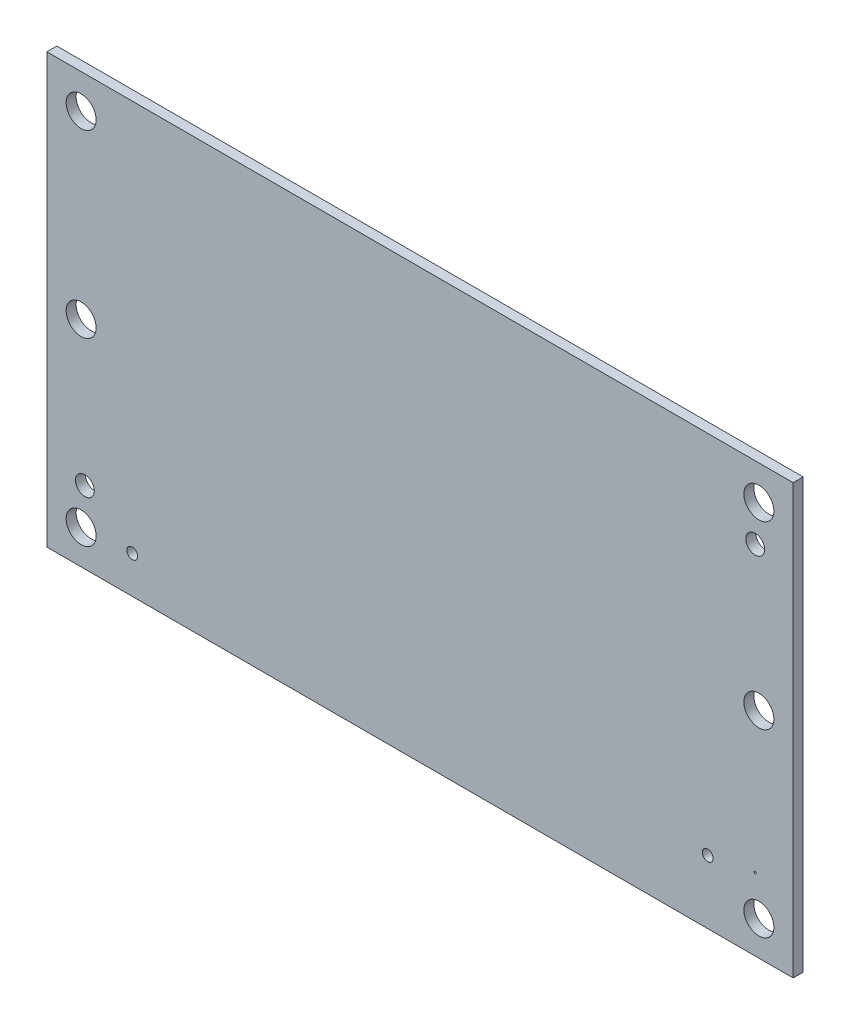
ISO-10303-21;
HEADER;
FILE_DESCRIPTION(('STEP AP214'),'2;1');
FILE_NAME('part.step','',(''),(''),'','','');
FILE_SCHEMA(('AUTOMOTIVE_DESIGN { 1 0 10303 214 1 1 1 1 }'));
ENDSEC;
DATA;
#1=APPLICATION_CONTEXT('core data for automotive mechanical design processes');
#2=APPLICATION_PROTOCOL_DEFINITION('international standard','automotive_design',2000,#1);
#3=PRODUCT_CONTEXT('',#1,'mechanical');
#4=PRODUCT('Part','Part','',(#3));
#5=PRODUCT_RELATED_PRODUCT_CATEGORY('part','',(#4));
#6=PRODUCT_DEFINITION_FORMATION('','',#4);
#7=PRODUCT_DEFINITION_CONTEXT('part definition',#1,'design');
#8=PRODUCT_DEFINITION('design','',#6,#7);
#9=PRODUCT_DEFINITION_SHAPE('','',#8);
#10=(LENGTH_UNIT() NAMED_UNIT(*) SI_UNIT(.MILLI.,.METRE.));
#11=(NAMED_UNIT(*) PLANE_ANGLE_UNIT() SI_UNIT($,.RADIAN.));
#12=(NAMED_UNIT(*) SI_UNIT($,.STERADIAN.) SOLID_ANGLE_UNIT());
#13=UNCERTAINTY_MEASURE_WITH_UNIT(LENGTH_MEASURE(1.E-05),#10,'distance_accuracy_value','');
#14=(GEOMETRIC_REPRESENTATION_CONTEXT(3) GLOBAL_UNCERTAINTY_ASSIGNED_CONTEXT((#13)) GLOBAL_UNIT_ASSIGNED_CONTEXT((#10,
#11,#12)) REPRESENTATION_CONTEXT('',''));
#15=CARTESIAN_POINT('',(0.,0.,0.));
#16=DIRECTION('',(0.,0.,1.));
#17=DIRECTION('',(1.,0.,0.));
#18=AXIS2_PLACEMENT_3D('',#15,#16,#17);
#19=CARTESIAN_POINT('',(0.,0.,1.16399999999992));
#20=DIRECTION('',(0.,0.,1.));
#21=DIRECTION('',(1.,0.,0.));
#22=AXIS2_PLACEMENT_3D('',#19,#20,#21);
#23=PLANE('',#22);
#24=CARTESIAN_POINT('',(5.9599999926,0.3500000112,1.16399999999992));
#25=DIRECTION('',(0.,0.,1.));
#26=DIRECTION('',(1.,0.,0.));
#27=AXIS2_PLACEMENT_3D('',#24,#25,#26);
#28=CIRCLE('',#27,0.635);
#29=CARTESIAN_POINT('',(6.5949999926,0.3500000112,1.16399999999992));
#30=VERTEX_POINT('',#29);
#31=EDGE_CURVE('E112',#30,#30,#28,.F.);
#32=ORIENTED_EDGE('',*,*,#31,.T.);
#33=EDGE_LOOP('',(#32));
#34=FACE_BOUND('',#33,.T.);
#35=CARTESIAN_POINT('',(73.0399999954,3.4000000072,1.16399999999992));
#36=DIRECTION('',(0.,0.,1.));
#37=DIRECTION('',(1.,0.,0.));
#38=AXIS2_PLACEMENT_3D('',#35,#36,#37);
#39=CIRCLE('',#38,0.635);
#40=CARTESIAN_POINT('',(73.6749999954,3.4000000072,1.16399999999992));
#41=VERTEX_POINT('',#40);
#42=EDGE_CURVE('E115',#41,#41,#39,.F.);
#43=ORIENTED_EDGE('',*,*,#42,.T.);
#44=EDGE_LOOP('',(#43));
#45=FACE_BOUND('',#44,.T.);
#46=CARTESIAN_POINT('',(78.5700000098,4.4300000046,1.16399999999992));
#47=DIRECTION('',(0.,0.,1.));
#48=DIRECTION('',(1.,0.,0.));
#49=AXIS2_PLACEMENT_3D('',#46,#47,#48);
#50=CIRCLE('',#49,0.125000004);
#51=CARTESIAN_POINT('',(78.6950000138,4.4300000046,1.16399999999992));
#52=VERTEX_POINT('',#51);
#53=EDGE_CURVE('E118',#52,#52,#50,.F.);
#54=ORIENTED_EDGE('',*,*,#53,.T.);
#55=EDGE_LOOP('',(#54));
#56=FACE_BOUND('',#55,.T.);
#57=CARTESIAN_POINT('',(78.5700000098,37.5799999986,1.16399999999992));
#58=DIRECTION('',(0.,0.,1.));
#59=DIRECTION('',(1.,0.,0.));
#60=AXIS2_PLACEMENT_3D('',#57,#58,#59);
#61=CIRCLE('',#60,1.0999999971);
#62=CARTESIAN_POINT('',(79.6700000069,37.5799999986,1.16399999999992));
#63=VERTEX_POINT('',#62);
#64=EDGE_CURVE('E121',#63,#63,#61,.F.);
#65=ORIENTED_EDGE('',*,*,#64,.T.);
#66=EDGE_LOOP('',(#65));
#67=FACE_BOUND('',#66,.T.);
#68=CARTESIAN_POINT('',(0.4319999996,4.4180000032,1.16399999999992));
#69=DIRECTION('',(0.,0.,1.));
#70=DIRECTION('',(1.,0.,0.));
#71=AXIS2_PLACEMENT_3D('',#68,#69,#70);
#72=CIRCLE('',#71,1.0999999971);
#73=CARTESIAN_POINT('',(1.5319999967,4.4180000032,1.16399999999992));
#74=VERTEX_POINT('',#73);
#75=EDGE_CURVE('E124',#74,#74,#72,.F.);
#76=ORIENTED_EDGE('',*,*,#75,.T.);
#77=EDGE_LOOP('',(#76));
#78=FACE_BOUND('',#77,.T.);
#79=CARTESIAN_POINT('',(78.999999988,41.9999999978,1.16399999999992));
#80=DIRECTION('',(0.,0.,1.));
#81=DIRECTION('',(1.,0.,0.));
#82=AXIS2_PLACEMENT_3D('',#79,#80,#81);
#83=CIRCLE('',#82,1.7500000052);
#84=CARTESIAN_POINT('',(80.7499999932,41.9999999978,1.16399999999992));
#85=VERTEX_POINT('',#84);
#86=EDGE_CURVE('E127',#85,#85,#83,.F.);
#87=ORIENTED_EDGE('',*,*,#86,.T.);
#88=EDGE_LOOP('',(#87));
#89=FACE_BOUND('',#88,.T.);
#90=CARTESIAN_POINT('',(78.999999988,21.0000000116,1.16399999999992));
#91=DIRECTION('',(0.,0.,1.));
#92=DIRECTION('',(1.,0.,0.));
#93=AXIS2_PLACEMENT_3D('',#90,#91,#92);
#94=CIRCLE('',#93,1.7500000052);
#95=CARTESIAN_POINT('',(80.7499999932,21.0000000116,1.16399999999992));
#96=VERTEX_POINT('',#95);
#97=EDGE_CURVE('E130',#96,#96,#94,.F.);
#98=ORIENTED_EDGE('',*,*,#97,.T.);
#99=EDGE_LOOP('',(#98));
#100=FACE_BOUND('',#99,.T.);
#101=CARTESIAN_POINT('',(78.999999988,0.,1.16399999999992));
#102=DIRECTION('',(0.,0.,1.));
#103=DIRECTION('',(1.,0.,0.));
#104=AXIS2_PLACEMENT_3D('',#101,#102,#103);
#105=CIRCLE('',#104,1.7500000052);
#106=CARTESIAN_POINT('',(80.7499999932,0.,1.16399999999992));
#107=VERTEX_POINT('',#106);
#108=EDGE_CURVE('E133',#107,#107,#105,.F.);
#109=ORIENTED_EDGE('',*,*,#108,.T.);
#110=EDGE_LOOP('',(#109));
#111=FACE_BOUND('',#110,.T.);
#112=CARTESIAN_POINT('',(0.,41.9999999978,1.16399999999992));
#113=DIRECTION('',(0.,0.,1.));
#114=DIRECTION('',(1.,0.,0.));
#115=AXIS2_PLACEMENT_3D('',#112,#113,#114);
#116=CIRCLE('',#115,1.7500000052);
#117=CARTESIAN_POINT('',(1.7500000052,41.9999999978,1.16399999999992));
#118=VERTEX_POINT('',#117);
#119=EDGE_CURVE('E136',#118,#118,#116,.F.);
#120=ORIENTED_EDGE('',*,*,#119,.T.);
#121=EDGE_LOOP('',(#120));
#122=FACE_BOUND('',#121,.T.);
#123=CARTESIAN_POINT('',(0.,21.0000000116,1.16399999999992));
#124=DIRECTION('',(0.,0.,1.));
#125=DIRECTION('',(1.,0.,0.));
#126=AXIS2_PLACEMENT_3D('',#123,#124,#125);
#127=CIRCLE('',#126,1.7500000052);
#128=CARTESIAN_POINT('',(1.7500000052,21.0000000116,1.16399999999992));
#129=VERTEX_POINT('',#128);
#130=EDGE_CURVE('E138',#129,#129,#127,.F.);
#131=ORIENTED_EDGE('',*,*,#130,.T.);
#132=EDGE_LOOP('',(#131));
#133=FACE_BOUND('',#132,.T.);
#134=CARTESIAN_POINT('',(0.,0.,1.16399999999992));
#135=DIRECTION('',(0.,0.,1.));
#136=DIRECTION('',(1.,0.,0.));
#137=AXIS2_PLACEMENT_3D('',#134,#135,#136);
#138=CIRCLE('',#137,1.7500000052);
#139=CARTESIAN_POINT('',(1.7500000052,0.,1.16399999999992));
#140=VERTEX_POINT('',#139);
#141=EDGE_CURVE('E19',#140,#140,#138,.F.);
#142=ORIENTED_EDGE('',*,*,#141,.T.);
#143=EDGE_LOOP('',(#142));
#144=FACE_BOUND('',#143,.T.);
#145=DIRECTION('',(0.,1.,0.));
#146=VECTOR('',#145,1.);
#147=CARTESIAN_POINT('',(-3.99999999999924,45.9999999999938,1.16399999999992));
#148=LINE('',#147,#146);
#149=CARTESIAN_POINT('',(-3.99999999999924,-3.99999999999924,1.16399999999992));
#150=VERTEX_POINT('',#149);
#151=CARTESIAN_POINT('',(-3.99999999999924,45.9999999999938,1.16399999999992));
#152=VERTEX_POINT('',#151);
#153=EDGE_CURVE('E70',#150,#152,#148,.T.);
#154=ORIENTED_EDGE('',*,*,#153,.F.);
#155=DIRECTION('',(1.,0.,0.));
#156=VECTOR('',#155,1.);
#157=CARTESIAN_POINT('',(-3.99999999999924,-3.99999999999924,1.16399999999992));
#158=LINE('',#157,#156);
#159=CARTESIAN_POINT('',(82.9999999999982,-3.99999999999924,1.16399999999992));
#160=VERTEX_POINT('',#159);
#161=EDGE_CURVE('E67',#160,#150,#158,.F.);
#162=ORIENTED_EDGE('',*,*,#161,.F.);
#163=DIRECTION('',(0.,1.,0.));
#164=VECTOR('',#163,1.);
#165=CARTESIAN_POINT('',(82.9999999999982,-3.99999999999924,1.16399999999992));
#166=LINE('',#165,#164);
#167=CARTESIAN_POINT('',(82.9999999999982,45.9999999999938,1.16399999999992));
#168=VERTEX_POINT('',#167);
#169=EDGE_CURVE('E58',#168,#160,#166,.F.);
#170=ORIENTED_EDGE('',*,*,#169,.F.);
#171=DIRECTION('',(1.,0.,0.));
#172=VECTOR('',#171,1.);
#173=CARTESIAN_POINT('',(82.9999999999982,45.9999999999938,1.16399999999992));
#174=LINE('',#173,#172);
#175=EDGE_CURVE('E53',#152,#168,#174,.T.);
#176=ORIENTED_EDGE('',*,*,#175,.F.);
#177=EDGE_LOOP('',(#154,#162,#170,#176));
#178=FACE_BOUND('',#177,.T.);
#179=ADVANCED_FACE('F16',(#34,#45,#56,#67,#78,#89,#100,#111,#122,#133,#144,#178),#23,.T.);
#180=CARTESIAN_POINT('',(-3.99999999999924,-3.99999999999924,0.));
#181=DIRECTION('',(0.,-1.,0.));
#182=DIRECTION('',(0.,0.,-1.));
#183=AXIS2_PLACEMENT_3D('',#180,#181,#182);
#184=PLANE('',#183);
#185=DIRECTION('',(0.,0.,1.));
#186=VECTOR('',#185,1.);
#187=CARTESIAN_POINT('',(-3.99999999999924,-3.99999999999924,0.));
#188=LINE('',#187,#186);
#189=CARTESIAN_POINT('',(-3.99999999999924,-3.99999999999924,0.));
#190=VERTEX_POINT('',#189);
#191=EDGE_CURVE('E146',#190,#150,#188,.T.);
#192=ORIENTED_EDGE('',*,*,#191,.F.);
#193=DIRECTION('',(1.,0.,0.));
#194=VECTOR('',#193,1.);
#195=CARTESIAN_POINT('',(0.,-3.99999999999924,0.));
#196=LINE('',#195,#194);
#197=CARTESIAN_POINT('',(82.9999999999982,-3.99999999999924,0.));
#198=VERTEX_POINT('',#197);
#199=EDGE_CURVE('E77',#190,#198,#196,.T.);
#200=ORIENTED_EDGE('',*,*,#199,.T.);
#201=DIRECTION('',(0.,0.,-1.));
#202=VECTOR('',#201,1.);
#203=CARTESIAN_POINT('',(82.9999999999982,-3.99999999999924,0.));
#204=LINE('',#203,#202);
#205=EDGE_CURVE('E63',#160,#198,#204,.T.);
#206=ORIENTED_EDGE('',*,*,#205,.F.);
#207=ORIENTED_EDGE('',*,*,#161,.T.);
#208=EDGE_LOOP('',(#192,#200,#206,#207));
#209=FACE_BOUND('',#208,.T.);
#210=ADVANCED_FACE('F76',(#209),#184,.T.);
#211=CARTESIAN_POINT('',(82.9999999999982,-3.99999999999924,0.));
#212=DIRECTION('',(1.,0.,0.));
#213=DIRECTION('',(0.,0.,-1.));
#214=AXIS2_PLACEMENT_3D('',#211,#212,#213);
#215=PLANE('',#214);
#216=ORIENTED_EDGE('',*,*,#205,.T.);
#217=DIRECTION('',(0.,1.,0.));
#218=VECTOR('',#217,1.);
#219=CARTESIAN_POINT('',(82.9999999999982,0.,0.));
#220=LINE('',#219,#218);
#221=CARTESIAN_POINT('',(82.9999999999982,45.9999999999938,0.));
#222=VERTEX_POINT('',#221);
#223=EDGE_CURVE('E157',#198,#222,#220,.T.);
#224=ORIENTED_EDGE('',*,*,#223,.T.);
#225=DIRECTION('',(0.,0.,1.));
#226=VECTOR('',#225,1.);
#227=CARTESIAN_POINT('',(82.9999999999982,45.9999999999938,0.));
#228=LINE('',#227,#226);
#229=EDGE_CURVE('E65',#168,#222,#228,.F.);
#230=ORIENTED_EDGE('',*,*,#229,.F.);
#231=ORIENTED_EDGE('',*,*,#169,.T.);
#232=EDGE_LOOP('',(#216,#224,#230,#231));
#233=FACE_BOUND('',#232,.T.);
#234=ADVANCED_FACE('F60',(#233),#215,.T.);
#235=CARTESIAN_POINT('',(82.9999999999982,45.9999999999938,0.));
#236=DIRECTION('',(0.,1.,0.));
#237=DIRECTION('',(0.,0.,1.));
#238=AXIS2_PLACEMENT_3D('',#235,#236,#237);
#239=PLANE('',#238);
#240=ORIENTED_EDGE('',*,*,#229,.T.);
#241=DIRECTION('',(1.,0.,0.));
#242=VECTOR('',#241,1.);
#243=CARTESIAN_POINT('',(0.,45.9999999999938,0.));
#244=LINE('',#243,#242);
#245=CARTESIAN_POINT('',(-3.99999999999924,45.9999999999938,0.));
#246=VERTEX_POINT('',#245);
#247=EDGE_CURVE('E154',#222,#246,#244,.F.);
#248=ORIENTED_EDGE('',*,*,#247,.T.);
#249=DIRECTION('',(0.,0.,1.));
#250=VECTOR('',#249,1.);
#251=CARTESIAN_POINT('',(-3.99999999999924,45.9999999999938,0.));
#252=LINE('',#251,#250);
#253=EDGE_CURVE('E34',#152,#246,#252,.F.);
#254=ORIENTED_EDGE('',*,*,#253,.F.);
#255=ORIENTED_EDGE('',*,*,#175,.T.);
#256=EDGE_LOOP('',(#240,#248,#254,#255));
#257=FACE_BOUND('',#256,.T.);
#258=ADVANCED_FACE('F153',(#257),#239,.T.);
#259=CARTESIAN_POINT('',(-3.99999999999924,45.9999999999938,0.));
#260=DIRECTION('',(-1.,0.,0.));
#261=DIRECTION('',(0.,0.,1.));
#262=AXIS2_PLACEMENT_3D('',#259,#260,#261);
#263=PLANE('',#262);
#264=ORIENTED_EDGE('',*,*,#253,.T.);
#265=DIRECTION('',(0.,1.,0.));
#266=VECTOR('',#265,1.);
#267=CARTESIAN_POINT('',(-3.99999999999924,0.,0.));
#268=LINE('',#267,#266);
#269=EDGE_CURVE('E111',#246,#190,#268,.F.);
#270=ORIENTED_EDGE('',*,*,#269,.T.);
#271=ORIENTED_EDGE('',*,*,#191,.T.);
#272=ORIENTED_EDGE('',*,*,#153,.T.);
#273=EDGE_LOOP('',(#264,#270,#271,#272));
#274=FACE_BOUND('',#273,.T.);
#275=ADVANCED_FACE('F160',(#274),#263,.T.);
#276=CARTESIAN_POINT('',(0.,0.,0.));
#277=DIRECTION('',(0.,0.,1.));
#278=DIRECTION('',(1.,0.,0.));
#279=AXIS2_PLACEMENT_3D('',#276,#277,#278);
#280=CYLINDRICAL_SURFACE('',#279,1.7500000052);
#281=ORIENTED_EDGE('',*,*,#141,.F.);
#282=EDGE_LOOP('',(#281));
#283=FACE_BOUND('',#282,.T.);
#284=CARTESIAN_POINT('',(0.,0.,0.));
#285=DIRECTION('',(0.,0.,1.));
#286=DIRECTION('',(1.,0.,0.));
#287=AXIS2_PLACEMENT_3D('',#284,#285,#286);
#288=CIRCLE('',#287,1.7500000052);
#289=CARTESIAN_POINT('',(1.7500000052,0.,0.));
#290=VERTEX_POINT('',#289);
#291=EDGE_CURVE('E108',#290,#290,#288,.F.);
#292=ORIENTED_EDGE('',*,*,#291,.T.);
#293=EDGE_LOOP('',(#292));
#294=FACE_BOUND('',#293,.T.);
#295=ADVANCED_FACE('F162',(#283,#294),#280,.F.);
#296=CARTESIAN_POINT('',(0.,21.0000000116,0.));
#297=DIRECTION('',(0.,0.,1.));
#298=DIRECTION('',(1.,0.,0.));
#299=AXIS2_PLACEMENT_3D('',#296,#297,#298);
#300=CYLINDRICAL_SURFACE('',#299,1.7500000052);
#301=ORIENTED_EDGE('',*,*,#130,.F.);
#302=EDGE_LOOP('',(#301));
#303=FACE_BOUND('',#302,.T.);
#304=CARTESIAN_POINT('',(0.,21.0000000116,0.));
#305=DIRECTION('',(0.,0.,1.));
#306=DIRECTION('',(1.,0.,0.));
#307=AXIS2_PLACEMENT_3D('',#304,#305,#306);
#308=CIRCLE('',#307,1.7500000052);
#309=CARTESIAN_POINT('',(1.7500000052,21.0000000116,0.));
#310=VERTEX_POINT('',#309);
#311=EDGE_CURVE('E105',#310,#310,#308,.F.);
#312=ORIENTED_EDGE('',*,*,#311,.T.);
#313=EDGE_LOOP('',(#312));
#314=FACE_BOUND('',#313,.T.);
#315=ADVANCED_FACE('F169',(#303,#314),#300,.F.);
#316=CARTESIAN_POINT('',(0.,41.9999999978,0.));
#317=DIRECTION('',(0.,0.,1.));
#318=DIRECTION('',(1.,0.,0.));
#319=AXIS2_PLACEMENT_3D('',#316,#317,#318);
#320=CYLINDRICAL_SURFACE('',#319,1.7500000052);
#321=ORIENTED_EDGE('',*,*,#119,.F.);
#322=EDGE_LOOP('',(#321));
#323=FACE_BOUND('',#322,.T.);
#324=CARTESIAN_POINT('',(0.,41.9999999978,0.));
#325=DIRECTION('',(0.,0.,1.));
#326=DIRECTION('',(1.,0.,0.));
#327=AXIS2_PLACEMENT_3D('',#324,#325,#326);
#328=CIRCLE('',#327,1.7500000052);
#329=CARTESIAN_POINT('',(1.7500000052,41.9999999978,0.));
#330=VERTEX_POINT('',#329);
#331=EDGE_CURVE('E102',#330,#330,#328,.F.);
#332=ORIENTED_EDGE('',*,*,#331,.T.);
#333=EDGE_LOOP('',(#332));
#334=FACE_BOUND('',#333,.T.);
#335=ADVANCED_FACE('F212',(#323,#334),#320,.F.);
#336=CARTESIAN_POINT('',(78.999999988,0.,0.));
#337=DIRECTION('',(0.,0.,1.));
#338=DIRECTION('',(1.,0.,0.));
#339=AXIS2_PLACEMENT_3D('',#336,#337,#338);
#340=CYLINDRICAL_SURFACE('',#339,1.7500000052);
#341=ORIENTED_EDGE('',*,*,#108,.F.);
#342=EDGE_LOOP('',(#341));
#343=FACE_BOUND('',#342,.T.);
#344=CARTESIAN_POINT('',(78.999999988,0.,0.));
#345=DIRECTION('',(0.,0.,1.));
#346=DIRECTION('',(1.,0.,0.));
#347=AXIS2_PLACEMENT_3D('',#344,#345,#346);
#348=CIRCLE('',#347,1.7500000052);
#349=CARTESIAN_POINT('',(80.7499999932,0.,0.));
#350=VERTEX_POINT('',#349);
#351=EDGE_CURVE('E99',#350,#350,#348,.F.);
#352=ORIENTED_EDGE('',*,*,#351,.T.);
#353=EDGE_LOOP('',(#352));
#354=FACE_BOUND('',#353,.T.);
#355=ADVANCED_FACE('F208',(#343,#354),#340,.F.);
#356=CARTESIAN_POINT('',(78.999999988,21.0000000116,0.));
#357=DIRECTION('',(0.,0.,1.));
#358=DIRECTION('',(1.,0.,0.));
#359=AXIS2_PLACEMENT_3D('',#356,#357,#358);
#360=CYLINDRICAL_SURFACE('',#359,1.7500000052);
#361=ORIENTED_EDGE('',*,*,#97,.F.);
#362=EDGE_LOOP('',(#361));
#363=FACE_BOUND('',#362,.T.);
#364=CARTESIAN_POINT('',(78.999999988,21.0000000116,0.));
#365=DIRECTION('',(0.,0.,1.));
#366=DIRECTION('',(1.,0.,0.));
#367=AXIS2_PLACEMENT_3D('',#364,#365,#366);
#368=CIRCLE('',#367,1.7500000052);
#369=CARTESIAN_POINT('',(80.7499999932,21.0000000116,0.));
#370=VERTEX_POINT('',#369);
#371=EDGE_CURVE('E96',#370,#370,#368,.F.);
#372=ORIENTED_EDGE('',*,*,#371,.T.);
#373=EDGE_LOOP('',(#372));
#374=FACE_BOUND('',#373,.T.);
#375=ADVANCED_FACE('F204',(#363,#374),#360,.F.);
#376=CARTESIAN_POINT('',(78.999999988,41.9999999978,0.));
#377=DIRECTION('',(0.,0.,1.));
#378=DIRECTION('',(1.,0.,0.));
#379=AXIS2_PLACEMENT_3D('',#376,#377,#378);
#380=CYLINDRICAL_SURFACE('',#379,1.7500000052);
#381=ORIENTED_EDGE('',*,*,#86,.F.);
#382=EDGE_LOOP('',(#381));
#383=FACE_BOUND('',#382,.T.);
#384=CARTESIAN_POINT('',(78.999999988,41.9999999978,0.));
#385=DIRECTION('',(0.,0.,1.));
#386=DIRECTION('',(1.,0.,0.));
#387=AXIS2_PLACEMENT_3D('',#384,#385,#386);
#388=CIRCLE('',#387,1.7500000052);
#389=CARTESIAN_POINT('',(80.7499999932,41.9999999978,0.));
#390=VERTEX_POINT('',#389);
#391=EDGE_CURVE('E93',#390,#390,#388,.F.);
#392=ORIENTED_EDGE('',*,*,#391,.T.);
#393=EDGE_LOOP('',(#392));
#394=FACE_BOUND('',#393,.T.);
#395=ADVANCED_FACE('F200',(#383,#394),#380,.F.);
#396=CARTESIAN_POINT('',(0.4319999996,4.4180000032,0.));
#397=DIRECTION('',(0.,0.,1.));
#398=DIRECTION('',(1.,0.,0.));
#399=AXIS2_PLACEMENT_3D('',#396,#397,#398);
#400=CYLINDRICAL_SURFACE('',#399,1.0999999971);
#401=ORIENTED_EDGE('',*,*,#75,.F.);
#402=EDGE_LOOP('',(#401));
#403=FACE_BOUND('',#402,.T.);
#404=CARTESIAN_POINT('',(0.4319999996,4.4180000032,0.));
#405=DIRECTION('',(0.,0.,1.));
#406=DIRECTION('',(1.,0.,0.));
#407=AXIS2_PLACEMENT_3D('',#404,#405,#406);
#408=CIRCLE('',#407,1.0999999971);
#409=CARTESIAN_POINT('',(1.5319999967,4.4180000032,0.));
#410=VERTEX_POINT('',#409);
#411=EDGE_CURVE('E90',#410,#410,#408,.F.);
#412=ORIENTED_EDGE('',*,*,#411,.T.);
#413=EDGE_LOOP('',(#412));
#414=FACE_BOUND('',#413,.T.);
#415=ADVANCED_FACE('F196',(#403,#414),#400,.F.);
#416=CARTESIAN_POINT('',(78.5700000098,37.5799999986,0.));
#417=DIRECTION('',(0.,0.,1.));
#418=DIRECTION('',(1.,0.,0.));
#419=AXIS2_PLACEMENT_3D('',#416,#417,#418);
#420=CYLINDRICAL_SURFACE('',#419,1.0999999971);
#421=ORIENTED_EDGE('',*,*,#64,.F.);
#422=EDGE_LOOP('',(#421));
#423=FACE_BOUND('',#422,.T.);
#424=CARTESIAN_POINT('',(78.5700000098,37.5799999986,0.));
#425=DIRECTION('',(0.,0.,1.));
#426=DIRECTION('',(1.,0.,0.));
#427=AXIS2_PLACEMENT_3D('',#424,#425,#426);
#428=CIRCLE('',#427,1.0999999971);
#429=CARTESIAN_POINT('',(79.6700000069,37.5799999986,0.));
#430=VERTEX_POINT('',#429);
#431=EDGE_CURVE('E87',#430,#430,#428,.F.);
#432=ORIENTED_EDGE('',*,*,#431,.T.);
#433=EDGE_LOOP('',(#432));
#434=FACE_BOUND('',#433,.T.);
#435=ADVANCED_FACE('F192',(#423,#434),#420,.F.);
#436=CARTESIAN_POINT('',(78.5700000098,4.4300000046,0.));
#437=DIRECTION('',(0.,0.,1.));
#438=DIRECTION('',(1.,0.,0.));
#439=AXIS2_PLACEMENT_3D('',#436,#437,#438);
#440=CYLINDRICAL_SURFACE('',#439,0.125000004);
#441=ORIENTED_EDGE('',*,*,#53,.F.);
#442=EDGE_LOOP('',(#441));
#443=FACE_BOUND('',#442,.T.);
#444=CARTESIAN_POINT('',(78.5700000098,4.4300000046,0.));
#445=DIRECTION('',(0.,0.,1.));
#446=DIRECTION('',(1.,0.,0.));
#447=AXIS2_PLACEMENT_3D('',#444,#445,#446);
#448=CIRCLE('',#447,0.125000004);
#449=CARTESIAN_POINT('',(78.6950000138,4.4300000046,0.));
#450=VERTEX_POINT('',#449);
#451=EDGE_CURVE('E84',#450,#450,#448,.F.);
#452=ORIENTED_EDGE('',*,*,#451,.T.);
#453=EDGE_LOOP('',(#452));
#454=FACE_BOUND('',#453,.T.);
#455=ADVANCED_FACE('F188',(#443,#454),#440,.F.);
#456=CARTESIAN_POINT('',(73.0399999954,3.4000000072,0.));
#457=DIRECTION('',(0.,0.,1.));
#458=DIRECTION('',(1.,0.,0.));
#459=AXIS2_PLACEMENT_3D('',#456,#457,#458);
#460=CYLINDRICAL_SURFACE('',#459,0.635);
#461=ORIENTED_EDGE('',*,*,#42,.F.);
#462=EDGE_LOOP('',(#461));
#463=FACE_BOUND('',#462,.T.);
#464=CARTESIAN_POINT('',(73.0399999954,3.4000000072,0.));
#465=DIRECTION('',(0.,0.,1.));
#466=DIRECTION('',(1.,0.,0.));
#467=AXIS2_PLACEMENT_3D('',#464,#465,#466);
#468=CIRCLE('',#467,0.635);
#469=CARTESIAN_POINT('',(73.6749999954,3.4000000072,0.));
#470=VERTEX_POINT('',#469);
#471=EDGE_CURVE('E25',#470,#470,#468,.F.);
#472=ORIENTED_EDGE('',*,*,#471,.T.);
#473=EDGE_LOOP('',(#472));
#474=FACE_BOUND('',#473,.T.);
#475=ADVANCED_FACE('F180',(#463,#474),#460,.F.);
#476=CARTESIAN_POINT('',(5.9599999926,0.3500000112,0.));
#477=DIRECTION('',(0.,0.,1.));
#478=DIRECTION('',(1.,0.,0.));
#479=AXIS2_PLACEMENT_3D('',#476,#477,#478);
#480=CYLINDRICAL_SURFACE('',#479,0.635);
#481=ORIENTED_EDGE('',*,*,#31,.F.);
#482=EDGE_LOOP('',(#481));
#483=FACE_BOUND('',#482,.T.);
#484=CARTESIAN_POINT('',(5.9599999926,0.3500000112,0.));
#485=DIRECTION('',(0.,0.,1.));
#486=DIRECTION('',(1.,0.,0.));
#487=AXIS2_PLACEMENT_3D('',#484,#485,#486);
#488=CIRCLE('',#487,0.635);
#489=CARTESIAN_POINT('',(6.5949999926,0.3500000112,0.));
#490=VERTEX_POINT('',#489);
#491=EDGE_CURVE('E11',#490,#490,#488,.F.);
#492=ORIENTED_EDGE('',*,*,#491,.T.);
#493=EDGE_LOOP('',(#492));
#494=FACE_BOUND('',#493,.T.);
#495=ADVANCED_FACE('F174',(#483,#494),#480,.F.);
#496=CARTESIAN_POINT('',(0.,0.,0.));
#497=DIRECTION('',(0.,0.,1.));
#498=DIRECTION('',(1.,0.,0.));
#499=AXIS2_PLACEMENT_3D('',#496,#497,#498);
#500=PLANE('',#499);
#501=ORIENTED_EDGE('',*,*,#491,.F.);
#502=EDGE_LOOP('',(#501));
#503=FACE_BOUND('',#502,.T.);
#504=ORIENTED_EDGE('',*,*,#471,.F.);
#505=EDGE_LOOP('',(#504));
#506=FACE_BOUND('',#505,.T.);
#507=ORIENTED_EDGE('',*,*,#451,.F.);
#508=EDGE_LOOP('',(#507));
#509=FACE_BOUND('',#508,.T.);
#510=ORIENTED_EDGE('',*,*,#431,.F.);
#511=EDGE_LOOP('',(#510));
#512=FACE_BOUND('',#511,.T.);
#513=ORIENTED_EDGE('',*,*,#411,.F.);
#514=EDGE_LOOP('',(#513));
#515=FACE_BOUND('',#514,.T.);
#516=ORIENTED_EDGE('',*,*,#391,.F.);
#517=EDGE_LOOP('',(#516));
#518=FACE_BOUND('',#517,.T.);
#519=ORIENTED_EDGE('',*,*,#371,.F.);
#520=EDGE_LOOP('',(#519));
#521=FACE_BOUND('',#520,.T.);
#522=ORIENTED_EDGE('',*,*,#351,.F.);
#523=EDGE_LOOP('',(#522));
#524=FACE_BOUND('',#523,.T.);
#525=ORIENTED_EDGE('',*,*,#331,.F.);
#526=EDGE_LOOP('',(#525));
#527=FACE_BOUND('',#526,.T.);
#528=ORIENTED_EDGE('',*,*,#311,.F.);
#529=EDGE_LOOP('',(#528));
#530=FACE_BOUND('',#529,.T.);
#531=ORIENTED_EDGE('',*,*,#291,.F.);
#532=EDGE_LOOP('',(#531));
#533=FACE_BOUND('',#532,.T.);
#534=ORIENTED_EDGE('',*,*,#247,.F.);
#535=ORIENTED_EDGE('',*,*,#223,.F.);
#536=ORIENTED_EDGE('',*,*,#199,.F.);
#537=ORIENTED_EDGE('',*,*,#269,.F.);
#538=EDGE_LOOP('',(#534,#535,#536,#537));
#539=FACE_BOUND('',#538,.T.);
#540=ADVANCED_FACE('F156',(#503,#506,#509,#512,#515,#518,#521,#524,#527,#530,#533,#539),#500,.F.);
#541=CLOSED_SHELL('',(#179,#210,#234,#258,#275,#295,#315,#335,#355,#375,#395,#415,#435,#455,
#475,#495,#540));
#542=MANIFOLD_SOLID_BREP('B1',#541);
#543=ADVANCED_BREP_SHAPE_REPRESENTATION('',(#18,#542),#14);
#544=SHAPE_DEFINITION_REPRESENTATION(#9,#543);
ENDSEC;
END-ISO-10303-21;
